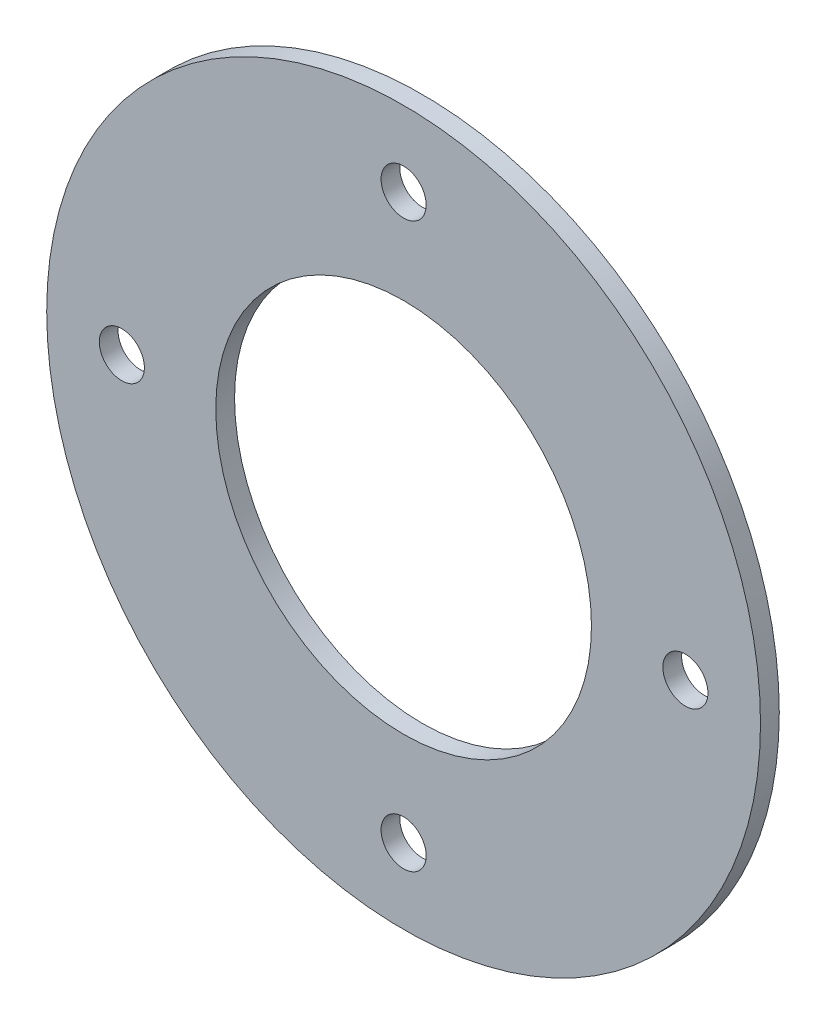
ISO-10303-21;
HEADER;
FILE_DESCRIPTION(('STEP AP214'),'2;1');
FILE_NAME('part.step','',(''),(''),'','','');
FILE_SCHEMA(('AUTOMOTIVE_DESIGN { 1 0 10303 214 1 1 1 1 }'));
ENDSEC;
DATA;
#1=APPLICATION_CONTEXT('core data for automotive mechanical design processes');
#2=APPLICATION_PROTOCOL_DEFINITION('international standard','automotive_design',2000,#1);
#3=PRODUCT_CONTEXT('',#1,'mechanical');
#4=PRODUCT('Part','Part','',(#3));
#5=PRODUCT_RELATED_PRODUCT_CATEGORY('part','',(#4));
#6=PRODUCT_DEFINITION_FORMATION('','',#4);
#7=PRODUCT_DEFINITION_CONTEXT('part definition',#1,'design');
#8=PRODUCT_DEFINITION('design','',#6,#7);
#9=PRODUCT_DEFINITION_SHAPE('','',#8);
#10=(LENGTH_UNIT() NAMED_UNIT(*) SI_UNIT(.MILLI.,.METRE.));
#11=(NAMED_UNIT(*) PLANE_ANGLE_UNIT() SI_UNIT($,.RADIAN.));
#12=(NAMED_UNIT(*) SI_UNIT($,.STERADIAN.) SOLID_ANGLE_UNIT());
#13=UNCERTAINTY_MEASURE_WITH_UNIT(LENGTH_MEASURE(1.E-05),#10,'distance_accuracy_value','');
#14=(GEOMETRIC_REPRESENTATION_CONTEXT(3) GLOBAL_UNCERTAINTY_ASSIGNED_CONTEXT((#13)) GLOBAL_UNIT_ASSIGNED_CONTEXT((#10,
#11,#12)) REPRESENTATION_CONTEXT('',''));
#15=CARTESIAN_POINT('',(0.,0.,0.));
#16=DIRECTION('',(0.,0.,1.));
#17=DIRECTION('',(1.,0.,0.));
#18=AXIS2_PLACEMENT_3D('',#15,#16,#17);
#19=CARTESIAN_POINT('',(0.,0.,5.));
#20=DIRECTION('',(0.,0.,1.));
#21=DIRECTION('',(1.,0.,0.));
#22=AXIS2_PLACEMENT_3D('',#19,#20,#21);
#23=PLANE('',#22);
#24=CARTESIAN_POINT('',(-75.,-7.86196059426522E-13,5.00000000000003));
#25=DIRECTION('',(0.,0.,-1.));
#26=DIRECTION('',(0.,1.,0.));
#27=AXIS2_PLACEMENT_3D('',#24,#25,#26);
#28=CIRCLE('',#27,6.);
#29=CARTESIAN_POINT('',(-75.0000000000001,5.99999999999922,5.00000000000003));
#30=VERTEX_POINT('',#29);
#31=EDGE_CURVE('E74',#30,#30,#28,.T.);
#32=ORIENTED_EDGE('',*,*,#31,.T.);
#33=EDGE_LOOP('',(#32));
#34=FACE_BOUND('',#33,.T.);
#35=CARTESIAN_POINT('',(-5.23722504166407E-13,75.,5.00000000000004));
#36=DIRECTION('',(0.,0.,-1.));
#37=DIRECTION('',(1.,0.,0.));
#38=AXIS2_PLACEMENT_3D('',#35,#36,#37);
#39=CIRCLE('',#38,6.);
#40=CARTESIAN_POINT('',(5.99999999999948,75.,5.00000000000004));
#41=VERTEX_POINT('',#40);
#42=EDGE_CURVE('E67',#41,#41,#39,.T.);
#43=ORIENTED_EDGE('',*,*,#42,.T.);
#44=EDGE_LOOP('',(#43));
#45=FACE_BOUND('',#44,.T.);
#46=CARTESIAN_POINT('',(75.,2.61248948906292E-13,5.00000000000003));
#47=DIRECTION('',(0.,0.,-1.));
#48=DIRECTION('',(0.,-1.,0.));
#49=AXIS2_PLACEMENT_3D('',#46,#47,#48);
#50=CIRCLE('',#49,6.);
#51=CARTESIAN_POINT('',(75.,-5.99999999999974,5.00000000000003));
#52=VERTEX_POINT('',#51);
#53=EDGE_CURVE('E60',#52,#52,#50,.T.);
#54=ORIENTED_EDGE('',*,*,#53,.T.);
#55=EDGE_LOOP('',(#54));
#56=FACE_BOUND('',#55,.T.);
#57=CARTESIAN_POINT('',(0.,-75.,5.));
#58=DIRECTION('',(0.,0.,-1.));
#59=DIRECTION('',(-1.,0.,0.));
#60=AXIS2_PLACEMENT_3D('',#57,#58,#59);
#61=CIRCLE('',#60,6.);
#62=CARTESIAN_POINT('',(-6.,-75.,5.));
#63=VERTEX_POINT('',#62);
#64=EDGE_CURVE('E53',#63,#63,#61,.T.);
#65=ORIENTED_EDGE('',*,*,#64,.T.);
#66=EDGE_LOOP('',(#65));
#67=FACE_BOUND('',#66,.T.);
#68=CARTESIAN_POINT('',(0.,0.,5.));
#69=DIRECTION('',(0.,0.,1.));
#70=DIRECTION('',(1.,0.,0.));
#71=AXIS2_PLACEMENT_3D('',#68,#69,#70);
#72=CIRCLE('',#71,95.);
#73=CARTESIAN_POINT('',(95.,0.,5.));
#74=VERTEX_POINT('',#73);
#75=EDGE_CURVE('E10',#74,#74,#72,.T.);
#76=ORIENTED_EDGE('',*,*,#75,.T.);
#77=EDGE_LOOP('',(#76));
#78=FACE_BOUND('',#77,.T.);
#79=CARTESIAN_POINT('',(0.,0.,5.));
#80=DIRECTION('',(0.,0.,1.));
#81=DIRECTION('',(1.,0.,0.));
#82=AXIS2_PLACEMENT_3D('',#79,#80,#81);
#83=CIRCLE('',#82,50.);
#84=CARTESIAN_POINT('',(50.,0.,5.));
#85=VERTEX_POINT('',#84);
#86=EDGE_CURVE('E44',#85,#85,#83,.T.);
#87=ORIENTED_EDGE('',*,*,#86,.F.);
#88=EDGE_LOOP('',(#87));
#89=FACE_BOUND('',#88,.T.);
#90=ADVANCED_FACE('F33',(#34,#45,#56,#67,#78,#89),#23,.T.);
#91=CARTESIAN_POINT('',(0.,0.,0.));
#92=DIRECTION('',(0.,0.,1.));
#93=DIRECTION('',(1.,0.,0.));
#94=AXIS2_PLACEMENT_3D('',#91,#92,#93);
#95=PLANE('',#94);
#96=CARTESIAN_POINT('',(-75.,-7.85583756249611E-13,0.));
#97=DIRECTION('',(0.,0.,-1.));
#98=DIRECTION('',(0.,1.,0.));
#99=AXIS2_PLACEMENT_3D('',#96,#97,#98);
#100=CIRCLE('',#99,6.);
#101=CARTESIAN_POINT('',(-75.0000000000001,5.99999999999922,0.));
#102=VERTEX_POINT('',#101);
#103=EDGE_CURVE('E78',#102,#102,#100,.T.);
#104=ORIENTED_EDGE('',*,*,#103,.F.);
#105=EDGE_LOOP('',(#104));
#106=FACE_BOUND('',#105,.T.);
#107=CARTESIAN_POINT('',(-5.23722504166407E-13,75.,0.));
#108=DIRECTION('',(0.,0.,-1.));
#109=DIRECTION('',(1.,0.,0.));
#110=AXIS2_PLACEMENT_3D('',#107,#108,#109);
#111=CIRCLE('',#110,6.);
#112=CARTESIAN_POINT('',(5.99999999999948,75.,0.));
#113=VERTEX_POINT('',#112);
#114=EDGE_CURVE('E71',#113,#113,#111,.T.);
#115=ORIENTED_EDGE('',*,*,#114,.F.);
#116=EDGE_LOOP('',(#115));
#117=FACE_BOUND('',#116,.T.);
#118=CARTESIAN_POINT('',(75.,2.61861252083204E-13,0.));
#119=DIRECTION('',(0.,0.,-1.));
#120=DIRECTION('',(0.,-1.,0.));
#121=AXIS2_PLACEMENT_3D('',#118,#119,#120);
#122=CIRCLE('',#121,6.);
#123=CARTESIAN_POINT('',(75.,-5.99999999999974,0.));
#124=VERTEX_POINT('',#123);
#125=EDGE_CURVE('E64',#124,#124,#122,.T.);
#126=ORIENTED_EDGE('',*,*,#125,.F.);
#127=EDGE_LOOP('',(#126));
#128=FACE_BOUND('',#127,.T.);
#129=CARTESIAN_POINT('',(0.,-75.,0.));
#130=DIRECTION('',(0.,0.,-1.));
#131=DIRECTION('',(-1.,0.,0.));
#132=AXIS2_PLACEMENT_3D('',#129,#130,#131);
#133=CIRCLE('',#132,6.);
#134=CARTESIAN_POINT('',(-6.,-75.,0.));
#135=VERTEX_POINT('',#134);
#136=EDGE_CURVE('E57',#135,#135,#133,.T.);
#137=ORIENTED_EDGE('',*,*,#136,.F.);
#138=EDGE_LOOP('',(#137));
#139=FACE_BOUND('',#138,.T.);
#140=CARTESIAN_POINT('',(0.,0.,0.));
#141=DIRECTION('',(0.,0.,1.));
#142=DIRECTION('',(1.,0.,0.));
#143=AXIS2_PLACEMENT_3D('',#140,#141,#142);
#144=CIRCLE('',#143,95.);
#145=CARTESIAN_POINT('',(95.,0.,0.));
#146=VERTEX_POINT('',#145);
#147=EDGE_CURVE('E40',#146,#146,#144,.T.);
#148=ORIENTED_EDGE('',*,*,#147,.F.);
#149=EDGE_LOOP('',(#148));
#150=FACE_BOUND('',#149,.T.);
#151=CARTESIAN_POINT('',(0.,0.,0.));
#152=DIRECTION('',(0.,0.,1.));
#153=DIRECTION('',(1.,0.,0.));
#154=AXIS2_PLACEMENT_3D('',#151,#152,#153);
#155=CIRCLE('',#154,50.);
#156=CARTESIAN_POINT('',(50.,0.,0.));
#157=VERTEX_POINT('',#156);
#158=EDGE_CURVE('E48',#157,#157,#155,.T.);
#159=ORIENTED_EDGE('',*,*,#158,.T.);
#160=EDGE_LOOP('',(#159));
#161=FACE_BOUND('',#160,.T.);
#162=ADVANCED_FACE('F84',(#106,#117,#128,#139,#150,#161),#95,.F.);
#163=CARTESIAN_POINT('',(0.,0.,5.));
#164=DIRECTION('',(0.,0.,-1.));
#165=DIRECTION('',(-1.,0.,0.));
#166=AXIS2_PLACEMENT_3D('',#163,#164,#165);
#167=CYLINDRICAL_SURFACE('',#166,95.);
#168=ORIENTED_EDGE('',*,*,#75,.F.);
#169=EDGE_LOOP('',(#168));
#170=FACE_BOUND('',#169,.T.);
#171=ORIENTED_EDGE('',*,*,#147,.T.);
#172=EDGE_LOOP('',(#171));
#173=FACE_BOUND('',#172,.T.);
#174=ADVANCED_FACE('F35',(#170,#173),#167,.T.);
#175=CARTESIAN_POINT('',(0.,0.,5.));
#176=DIRECTION('',(0.,0.,-1.));
#177=DIRECTION('',(-1.,0.,0.));
#178=AXIS2_PLACEMENT_3D('',#175,#176,#177);
#179=CYLINDRICAL_SURFACE('',#178,50.);
#180=ORIENTED_EDGE('',*,*,#86,.T.);
#181=EDGE_LOOP('',(#180));
#182=FACE_BOUND('',#181,.T.);
#183=ORIENTED_EDGE('',*,*,#158,.F.);
#184=EDGE_LOOP('',(#183));
#185=FACE_BOUND('',#184,.T.);
#186=ADVANCED_FACE('F97',(#182,#185),#179,.F.);
#187=CARTESIAN_POINT('',(0.,-75.,5.));
#188=DIRECTION('',(0.,0.,-1.));
#189=DIRECTION('',(-1.,0.,0.));
#190=AXIS2_PLACEMENT_3D('',#187,#188,#189);
#191=CYLINDRICAL_SURFACE('',#190,6.);
#192=ORIENTED_EDGE('',*,*,#64,.F.);
#193=EDGE_LOOP('',(#192));
#194=FACE_BOUND('',#193,.T.);
#195=ORIENTED_EDGE('',*,*,#136,.T.);
#196=EDGE_LOOP('',(#195));
#197=FACE_BOUND('',#196,.T.);
#198=ADVANCED_FACE('F99',(#194,#197),#191,.F.);
#199=CARTESIAN_POINT('',(75.,2.61248948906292E-13,5.00000000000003));
#200=DIRECTION('',(0.,0.,-1.));
#201=DIRECTION('',(0.,1.,0.));
#202=AXIS2_PLACEMENT_3D('',#199,#200,#201);
#203=CYLINDRICAL_SURFACE('',#202,6.);
#204=ORIENTED_EDGE('',*,*,#53,.F.);
#205=EDGE_LOOP('',(#204));
#206=FACE_BOUND('',#205,.T.);
#207=ORIENTED_EDGE('',*,*,#125,.T.);
#208=EDGE_LOOP('',(#207));
#209=FACE_BOUND('',#208,.T.);
#210=ADVANCED_FACE('F106',(#206,#209),#203,.F.);
#211=CARTESIAN_POINT('',(-5.23722504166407E-13,75.,5.00000000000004));
#212=DIRECTION('',(0.,0.,-1.));
#213=DIRECTION('',(0.,1.,0.));
#214=AXIS2_PLACEMENT_3D('',#211,#212,#213);
#215=CYLINDRICAL_SURFACE('',#214,6.);
#216=ORIENTED_EDGE('',*,*,#42,.F.);
#217=EDGE_LOOP('',(#216));
#218=FACE_BOUND('',#217,.T.);
#219=ORIENTED_EDGE('',*,*,#114,.T.);
#220=EDGE_LOOP('',(#219));
#221=FACE_BOUND('',#220,.T.);
#222=ADVANCED_FACE('F127',(#218,#221),#215,.F.);
#223=CARTESIAN_POINT('',(-75.,-7.86196059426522E-13,5.00000000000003));
#224=DIRECTION('',(0.,0.,-1.));
#225=DIRECTION('',(-1.,0.,0.));
#226=AXIS2_PLACEMENT_3D('',#223,#224,#225);
#227=CYLINDRICAL_SURFACE('',#226,6.);
#228=ORIENTED_EDGE('',*,*,#31,.F.);
#229=EDGE_LOOP('',(#228));
#230=FACE_BOUND('',#229,.T.);
#231=ORIENTED_EDGE('',*,*,#103,.T.);
#232=EDGE_LOOP('',(#231));
#233=FACE_BOUND('',#232,.T.);
#234=ADVANCED_FACE('F82',(#230,#233),#227,.F.);
#235=CLOSED_SHELL('',(#90,#162,#174,#186,#198,#210,#222,#234));
#236=MANIFOLD_SOLID_BREP('B2',#235);
#237=ADVANCED_BREP_SHAPE_REPRESENTATION('',(#18,#236),#14);
#238=SHAPE_DEFINITION_REPRESENTATION(#9,#237);
ENDSEC;
END-ISO-10303-21;
